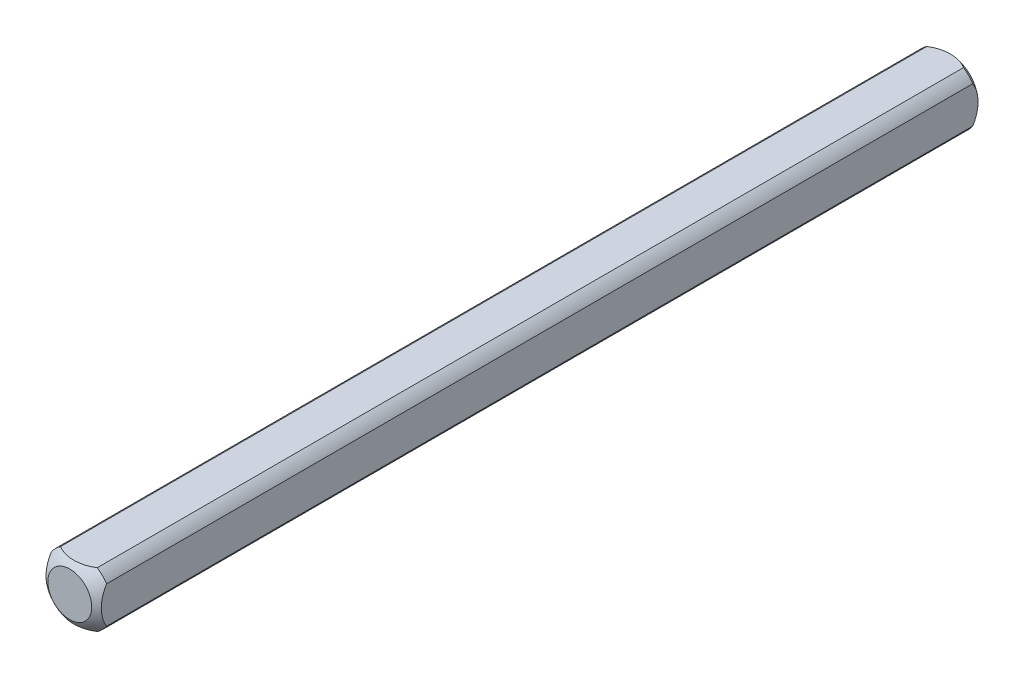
from build123d import *

# Parameters (mm, degrees)
SKETCH1_W           = 6.35
SKETCH1_H           = 6.35
BOSS_EXTRUDE1_DEPTH = 50.8
SKETCH2_OUTSIDE_W   = 18.668
SKETCH2_OUTSIDE_H   = 18.668
SKETCH2_OUTSIDE_R   = 3.81
CUT_EXTRUDE1_DEPTH  = 51.998051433


with BuildPart() as part:
    # Sketch1 → Boss-Extrude1 (new body)
    with BuildSketch(Plane.XY):
        Rectangle(SKETCH1_W, SKETCH1_H)
    extrude(amount=BOSS_EXTRUDE1_DEPTH)

    # Sketch2 outside → Cut-Extrude1 (cut, through all)
    with BuildSketch(Plane(origin=(0, 0, 0), x_dir=(-1, 0, 0), z_dir=(0, 0, -1))):
        Rectangle(SKETCH2_OUTSIDE_W, SKETCH2_OUTSIDE_H)
        Circle(SKETCH2_OUTSIDE_R, mode=Mode.SUBTRACT)
    extrude(amount=-CUT_EXTRUDE1_DEPTH, mode=Mode.SUBTRACT)

    # Sketch3 → Cut-Revolve1 (revolve, cut)
    with BuildSketch(Plane(origin=(0, 0, 0), x_dir=(1, 0, 0), z_dir=(0, 1, 0))):
        with BuildLine():
            Line((-5.053685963, -3.893335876), (-5.053685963, 5.740530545))
            Line((-5.053685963, 5.740530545), (0, 5.740530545))
            Line((0, 5.740530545), (0, 0.670274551))
            ThreePointArc((0, 0.670274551), (-3.404639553, -0.639469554), (-5.053685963, -3.893335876))
        make_face()
    revolve(axis=Axis((0, 0, 50.8), (0, 0, -1)), mode=Mode.SUBTRACT)

    # Mirror1: part across plane


with BuildPart() as part_1:
    add(part.part)
    add(part.part.mirror(Plane(origin=(0, 0, 50.8), x_dir=(1, 0, 0), z_dir=(0, 0, -1))))


solid = part_1.part
